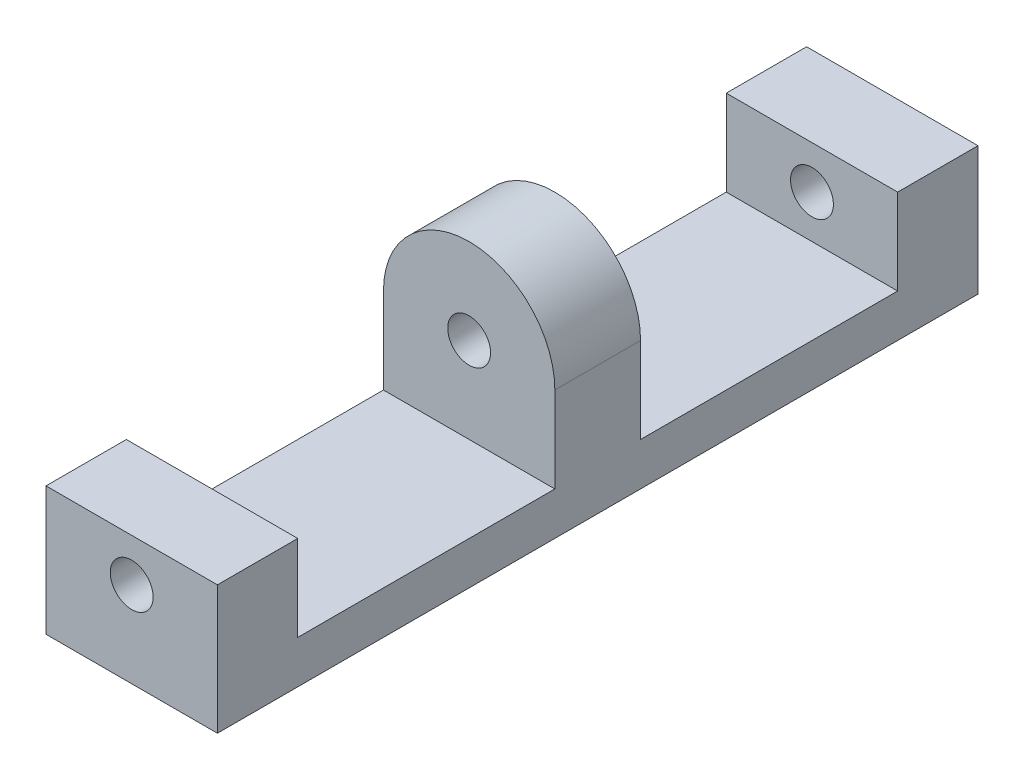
ISO-10303-21;
HEADER;
FILE_DESCRIPTION(('STEP AP214'),'2;1');
FILE_NAME('part.step','',(''),(''),'','','');
FILE_SCHEMA(('AUTOMOTIVE_DESIGN { 1 0 10303 214 1 1 1 1 }'));
ENDSEC;
DATA;
#1=APPLICATION_CONTEXT('core data for automotive mechanical design processes');
#2=APPLICATION_PROTOCOL_DEFINITION('international standard','automotive_design',2000,#1);
#3=PRODUCT_CONTEXT('',#1,'mechanical');
#4=PRODUCT('Part','Part','',(#3));
#5=PRODUCT_RELATED_PRODUCT_CATEGORY('part','',(#4));
#6=PRODUCT_DEFINITION_FORMATION('','',#4);
#7=PRODUCT_DEFINITION_CONTEXT('part definition',#1,'design');
#8=PRODUCT_DEFINITION('design','',#6,#7);
#9=PRODUCT_DEFINITION_SHAPE('','',#8);
#10=(LENGTH_UNIT() NAMED_UNIT(*) SI_UNIT(.MILLI.,.METRE.));
#11=(NAMED_UNIT(*) PLANE_ANGLE_UNIT() SI_UNIT($,.RADIAN.));
#12=(NAMED_UNIT(*) SI_UNIT($,.STERADIAN.) SOLID_ANGLE_UNIT());
#13=UNCERTAINTY_MEASURE_WITH_UNIT(LENGTH_MEASURE(1.E-05),#10,'distance_accuracy_value','');
#14=(GEOMETRIC_REPRESENTATION_CONTEXT(3) GLOBAL_UNCERTAINTY_ASSIGNED_CONTEXT((#13)) GLOBAL_UNIT_ASSIGNED_CONTEXT((#10,
#11,#12)) REPRESENTATION_CONTEXT('',''));
#15=CARTESIAN_POINT('',(0.,0.,0.));
#16=DIRECTION('',(0.,0.,1.));
#17=DIRECTION('',(1.,0.,0.));
#18=AXIS2_PLACEMENT_3D('',#15,#16,#17);
#19=CARTESIAN_POINT('',(50.8,0.,225.425));
#20=DIRECTION('',(-1.,0.,0.));
#21=DIRECTION('',(0.,0.,1.));
#22=AXIS2_PLACEMENT_3D('',#19,#20,#21);
#23=PLANE('',#22);
#24=DIRECTION('',(0.,0.,1.));
#25=VECTOR('',#24,1.);
#26=CARTESIAN_POINT('',(50.8,38.1,-199.542692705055));
#27=LINE('',#26,#25);
#28=CARTESIAN_POINT('',(50.8,38.1,100.0125));
#29=VERTEX_POINT('',#28);
#30=CARTESIAN_POINT('',(50.8,38.1,125.4125));
#31=VERTEX_POINT('',#30);
#32=EDGE_CURVE('E136',#29,#31,#27,.T.);
#33=ORIENTED_EDGE('',*,*,#32,.T.);
#34=DIRECTION('',(0.,-1.,0.));
#35=VECTOR('',#34,1.);
#36=CARTESIAN_POINT('',(50.8,63.5,125.4125));
#37=LINE('',#36,#35);
#38=CARTESIAN_POINT('',(50.8,12.7,125.4125));
#39=VERTEX_POINT('',#38);
#40=EDGE_CURVE('E239',#31,#39,#37,.T.);
#41=ORIENTED_EDGE('',*,*,#40,.T.);
#42=DIRECTION('',(0.,0.,-1.));
#43=VECTOR('',#42,1.);
#44=CARTESIAN_POINT('',(50.8,12.7,201.6125));
#45=LINE('',#44,#43);
#46=CARTESIAN_POINT('',(50.8,12.7,201.6125));
#47=VERTEX_POINT('',#46);
#48=EDGE_CURVE('E173',#47,#39,#45,.T.);
#49=ORIENTED_EDGE('',*,*,#48,.F.);
#50=DIRECTION('',(0.,-1.,0.));
#51=VECTOR('',#50,1.);
#52=CARTESIAN_POINT('',(50.8,38.1,201.6125));
#53=LINE('',#52,#51);
#54=CARTESIAN_POINT('',(50.8,38.1,201.6125));
#55=VERTEX_POINT('',#54);
#56=EDGE_CURVE('E158',#55,#47,#53,.T.);
#57=ORIENTED_EDGE('',*,*,#56,.F.);
#58=DIRECTION('',(0.,0.,-1.));
#59=VECTOR('',#58,1.);
#60=CARTESIAN_POINT('',(50.8,38.1,225.425));
#61=LINE('',#60,#59);
#62=CARTESIAN_POINT('',(50.8,38.1,225.425));
#63=VERTEX_POINT('',#62);
#64=EDGE_CURVE('E211',#63,#55,#61,.T.);
#65=ORIENTED_EDGE('',*,*,#64,.F.);
#66=DIRECTION('',(0.,1.,0.));
#67=VECTOR('',#66,1.);
#68=CARTESIAN_POINT('',(50.8,0.,225.425));
#69=LINE('',#68,#67);
#70=CARTESIAN_POINT('',(50.8,0.,225.425));
#71=VERTEX_POINT('',#70);
#72=EDGE_CURVE('E193',#71,#63,#69,.T.);
#73=ORIENTED_EDGE('',*,*,#72,.F.);
#74=DIRECTION('',(0.,0.,-1.));
#75=VECTOR('',#74,1.);
#76=CARTESIAN_POINT('',(50.8,0.,225.425));
#77=LINE('',#76,#75);
#78=CARTESIAN_POINT('',(50.8,0.,0.));
#79=VERTEX_POINT('',#78);
#80=EDGE_CURVE('E45',#71,#79,#77,.T.);
#81=ORIENTED_EDGE('',*,*,#80,.T.);
#82=DIRECTION('',(0.,1.,0.));
#83=VECTOR('',#82,1.);
#84=CARTESIAN_POINT('',(50.8,0.,0.));
#85=LINE('',#84,#83);
#86=CARTESIAN_POINT('',(50.8,38.1,0.));
#87=VERTEX_POINT('',#86);
#88=EDGE_CURVE('E202',#79,#87,#85,.T.);
#89=ORIENTED_EDGE('',*,*,#88,.T.);
#90=CARTESIAN_POINT('',(50.8,38.1,23.8125));
#91=VERTEX_POINT('',#90);
#92=EDGE_CURVE('E210',#91,#87,#61,.T.);
#93=ORIENTED_EDGE('',*,*,#92,.F.);
#94=DIRECTION('',(0.,1.,0.));
#95=VECTOR('',#94,1.);
#96=CARTESIAN_POINT('',(50.8,38.1,23.8125));
#97=LINE('',#96,#95);
#98=CARTESIAN_POINT('',(50.8,12.7,23.8125));
#99=VERTEX_POINT('',#98);
#100=EDGE_CURVE('E163',#99,#91,#97,.T.);
#101=ORIENTED_EDGE('',*,*,#100,.F.);
#102=CARTESIAN_POINT('',(50.8,12.7,100.0125));
#103=VERTEX_POINT('',#102);
#104=EDGE_CURVE('E143',#103,#99,#45,.T.);
#105=ORIENTED_EDGE('',*,*,#104,.F.);
#106=DIRECTION('',(0.,-1.,0.));
#107=VECTOR('',#106,1.);
#108=CARTESIAN_POINT('',(50.8,63.5,100.0125));
#109=LINE('',#108,#107);
#110=EDGE_CURVE('E130',#29,#103,#109,.T.);
#111=ORIENTED_EDGE('',*,*,#110,.F.);
#112=EDGE_LOOP('',(#33,#41,#49,#57,#65,#73,#81,#89,#93,#101,#105,#111));
#113=FACE_BOUND('',#112,.T.);
#114=ADVANCED_FACE('F36',(#113),#23,.F.);
#115=CARTESIAN_POINT('',(0.,12.7,201.6125));
#116=DIRECTION('',(0.,-1.,0.));
#117=DIRECTION('',(0.,0.,-1.));
#118=AXIS2_PLACEMENT_3D('',#115,#116,#117);
#119=PLANE('',#118);
#120=DIRECTION('',(-1.,0.,0.));
#121=VECTOR('',#120,1.);
#122=CARTESIAN_POINT('',(50.8,12.7,100.0125));
#123=LINE('',#122,#121);
#124=CARTESIAN_POINT('',(0.,12.7,100.0125));
#125=VERTEX_POINT('',#124);
#126=EDGE_CURVE('E234',#103,#125,#123,.T.);
#127=ORIENTED_EDGE('',*,*,#126,.F.);
#128=ORIENTED_EDGE('',*,*,#104,.T.);
#129=DIRECTION('',(1.,0.,0.));
#130=VECTOR('',#129,1.);
#131=CARTESIAN_POINT('',(0.,12.7,23.8125));
#132=LINE('',#131,#130);
#133=CARTESIAN_POINT('',(0.,12.7,23.8125));
#134=VERTEX_POINT('',#133);
#135=EDGE_CURVE('E183',#134,#99,#132,.T.);
#136=ORIENTED_EDGE('',*,*,#135,.F.);
#137=DIRECTION('',(0.,0.,-1.));
#138=VECTOR('',#137,1.);
#139=CARTESIAN_POINT('',(0.,12.7,201.6125));
#140=LINE('',#139,#138);
#141=EDGE_CURVE('E162',#125,#134,#140,.T.);
#142=ORIENTED_EDGE('',*,*,#141,.F.);
#143=EDGE_LOOP('',(#127,#128,#136,#142));
#144=FACE_BOUND('',#143,.T.);
#145=ADVANCED_FACE('F233',(#144),#119,.F.);
#146=DIRECTION('',(1.,0.,0.));
#147=VECTOR('',#146,1.);
#148=CARTESIAN_POINT('',(50.8,12.7,125.4125));
#149=LINE('',#148,#147);
#150=CARTESIAN_POINT('',(0.,12.7,125.4125));
#151=VERTEX_POINT('',#150);
#152=EDGE_CURVE('E235',#151,#39,#149,.T.);
#153=ORIENTED_EDGE('',*,*,#152,.F.);
#154=CARTESIAN_POINT('',(0.,12.7,201.6125));
#155=VERTEX_POINT('',#154);
#156=EDGE_CURVE('E164',#155,#151,#140,.T.);
#157=ORIENTED_EDGE('',*,*,#156,.F.);
#158=DIRECTION('',(1.,0.,0.));
#159=VECTOR('',#158,1.);
#160=CARTESIAN_POINT('',(0.,12.7,201.6125));
#161=LINE('',#160,#159);
#162=EDGE_CURVE('E170',#155,#47,#161,.T.);
#163=ORIENTED_EDGE('',*,*,#162,.T.);
#164=ORIENTED_EDGE('',*,*,#48,.T.);
#165=EDGE_LOOP('',(#153,#157,#163,#164));
#166=FACE_BOUND('',#165,.T.);
#167=ADVANCED_FACE('F250',(#166),#119,.F.);
#168=CARTESIAN_POINT('',(0.,38.1,225.425));
#169=DIRECTION('',(0.,-1.,0.));
#170=DIRECTION('',(0.,0.,-1.));
#171=AXIS2_PLACEMENT_3D('',#168,#169,#170);
#172=PLANE('',#171);
#173=ORIENTED_EDGE('',*,*,#64,.T.);
#174=DIRECTION('',(1.,0.,0.));
#175=VECTOR('',#174,1.);
#176=CARTESIAN_POINT('',(0.,38.1,201.6125));
#177=LINE('',#176,#175);
#178=CARTESIAN_POINT('',(0.,38.1,201.6125));
#179=VERTEX_POINT('',#178);
#180=EDGE_CURVE('E177',#179,#55,#177,.T.);
#181=ORIENTED_EDGE('',*,*,#180,.F.);
#182=DIRECTION('',(0.,0.,-1.));
#183=VECTOR('',#182,1.);
#184=CARTESIAN_POINT('',(0.,38.1,225.425));
#185=LINE('',#184,#183);
#186=CARTESIAN_POINT('',(0.,38.1,225.425));
#187=VERTEX_POINT('',#186);
#188=EDGE_CURVE('E207',#187,#179,#185,.T.);
#189=ORIENTED_EDGE('',*,*,#188,.F.);
#190=DIRECTION('',(-1.,0.,0.));
#191=VECTOR('',#190,1.);
#192=CARTESIAN_POINT('',(0.,38.1,225.425));
#193=LINE('',#192,#191);
#194=EDGE_CURVE('E195',#63,#187,#193,.T.);
#195=ORIENTED_EDGE('',*,*,#194,.F.);
#196=EDGE_LOOP('',(#173,#181,#189,#195));
#197=FACE_BOUND('',#196,.T.);
#198=ADVANCED_FACE('F259',(#197),#172,.F.);
#199=CARTESIAN_POINT('',(0.,0.,225.425));
#200=DIRECTION('',(1.,0.,0.));
#201=DIRECTION('',(0.,0.,-1.));
#202=AXIS2_PLACEMENT_3D('',#199,#200,#201);
#203=PLANE('',#202);
#204=DIRECTION('',(0.,-1.,0.));
#205=VECTOR('',#204,1.);
#206=CARTESIAN_POINT('',(0.,63.5,125.4125));
#207=LINE('',#206,#205);
#208=CARTESIAN_POINT('',(0.,38.1,125.4125));
#209=VERTEX_POINT('',#208);
#210=EDGE_CURVE('E149',#209,#151,#207,.T.);
#211=ORIENTED_EDGE('',*,*,#210,.F.);
#212=DIRECTION('',(0.,0.,1.));
#213=VECTOR('',#212,1.);
#214=CARTESIAN_POINT('',(0.,38.1,-199.542692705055));
#215=LINE('',#214,#213);
#216=CARTESIAN_POINT('',(0.,38.1,100.0125));
#217=VERTEX_POINT('',#216);
#218=EDGE_CURVE('E139',#217,#209,#215,.T.);
#219=ORIENTED_EDGE('',*,*,#218,.F.);
#220=DIRECTION('',(0.,-1.,0.));
#221=VECTOR('',#220,1.);
#222=CARTESIAN_POINT('',(0.,63.5,100.0125));
#223=LINE('',#222,#221);
#224=EDGE_CURVE('E60',#217,#125,#223,.T.);
#225=ORIENTED_EDGE('',*,*,#224,.T.);
#226=ORIENTED_EDGE('',*,*,#141,.T.);
#227=DIRECTION('',(0.,1.,0.));
#228=VECTOR('',#227,1.);
#229=CARTESIAN_POINT('',(0.,38.1,23.8125));
#230=LINE('',#229,#228);
#231=CARTESIAN_POINT('',(0.,38.1,23.8125));
#232=VERTEX_POINT('',#231);
#233=EDGE_CURVE('E167',#134,#232,#230,.T.);
#234=ORIENTED_EDGE('',*,*,#233,.T.);
#235=CARTESIAN_POINT('',(0.,38.1,0.));
#236=VERTEX_POINT('',#235);
#237=EDGE_CURVE('E197',#232,#236,#185,.T.);
#238=ORIENTED_EDGE('',*,*,#237,.T.);
#239=DIRECTION('',(0.,-1.,0.));
#240=VECTOR('',#239,1.);
#241=CARTESIAN_POINT('',(0.,0.,0.));
#242=LINE('',#241,#240);
#243=CARTESIAN_POINT('',(0.,0.,0.));
#244=VERTEX_POINT('',#243);
#245=EDGE_CURVE('E179',#236,#244,#242,.T.);
#246=ORIENTED_EDGE('',*,*,#245,.T.);
#247=DIRECTION('',(0.,0.,-1.));
#248=VECTOR('',#247,1.);
#249=CARTESIAN_POINT('',(0.,0.,225.425));
#250=LINE('',#249,#248);
#251=CARTESIAN_POINT('',(0.,0.,225.425));
#252=VERTEX_POINT('',#251);
#253=EDGE_CURVE('E11',#252,#244,#250,.T.);
#254=ORIENTED_EDGE('',*,*,#253,.F.);
#255=DIRECTION('',(0.,-1.,0.));
#256=VECTOR('',#255,1.);
#257=CARTESIAN_POINT('',(0.,0.,225.425));
#258=LINE('',#257,#256);
#259=EDGE_CURVE('E187',#187,#252,#258,.T.);
#260=ORIENTED_EDGE('',*,*,#259,.F.);
#261=ORIENTED_EDGE('',*,*,#188,.T.);
#262=DIRECTION('',(0.,-1.,0.));
#263=VECTOR('',#262,1.);
#264=CARTESIAN_POINT('',(0.,38.1,201.6125));
#265=LINE('',#264,#263);
#266=EDGE_CURVE('E159',#179,#155,#265,.T.);
#267=ORIENTED_EDGE('',*,*,#266,.T.);
#268=ORIENTED_EDGE('',*,*,#156,.T.);
#269=EDGE_LOOP('',(#211,#219,#225,#226,#234,#238,#246,#254,#260,#261,#267,#268));
#270=FACE_BOUND('',#269,.T.);
#271=ADVANCED_FACE('F38',(#270),#203,.F.);
#272=CARTESIAN_POINT('',(0.,0.,225.425));
#273=DIRECTION('',(0.,1.,0.));
#274=DIRECTION('',(0.,0.,1.));
#275=AXIS2_PLACEMENT_3D('',#272,#273,#274);
#276=PLANE('',#275);
#277=DIRECTION('',(1.,0.,0.));
#278=VECTOR('',#277,1.);
#279=CARTESIAN_POINT('',(0.,0.,0.));
#280=LINE('',#279,#278);
#281=EDGE_CURVE('E200',#244,#79,#280,.T.);
#282=ORIENTED_EDGE('',*,*,#281,.T.);
#283=ORIENTED_EDGE('',*,*,#80,.F.);
#284=DIRECTION('',(1.,0.,0.));
#285=VECTOR('',#284,1.);
#286=CARTESIAN_POINT('',(0.,0.,225.425));
#287=LINE('',#286,#285);
#288=EDGE_CURVE('E190',#252,#71,#287,.T.);
#289=ORIENTED_EDGE('',*,*,#288,.F.);
#290=ORIENTED_EDGE('',*,*,#253,.T.);
#291=EDGE_LOOP('',(#282,#283,#289,#290));
#292=FACE_BOUND('',#291,.T.);
#293=ADVANCED_FACE('F264',(#292),#276,.F.);
#294=ORIENTED_EDGE('',*,*,#237,.F.);
#295=DIRECTION('',(1.,0.,0.));
#296=VECTOR('',#295,1.);
#297=CARTESIAN_POINT('',(0.,38.1,23.8125));
#298=LINE('',#297,#296);
#299=EDGE_CURVE('E180',#232,#91,#298,.T.);
#300=ORIENTED_EDGE('',*,*,#299,.T.);
#301=ORIENTED_EDGE('',*,*,#92,.T.);
#302=DIRECTION('',(-1.,0.,0.));
#303=VECTOR('',#302,1.);
#304=CARTESIAN_POINT('',(0.,38.1,0.));
#305=LINE('',#304,#303);
#306=EDGE_CURVE('E191',#87,#236,#305,.T.);
#307=ORIENTED_EDGE('',*,*,#306,.T.);
#308=EDGE_LOOP('',(#294,#300,#301,#307));
#309=FACE_BOUND('',#308,.T.);
#310=ADVANCED_FACE('F227',(#309),#172,.F.);
#311=CARTESIAN_POINT('',(0.,38.1,225.425));
#312=DIRECTION('',(0.,0.,-1.));
#313=DIRECTION('',(-1.,0.,0.));
#314=AXIS2_PLACEMENT_3D('',#311,#312,#313);
#315=PLANE('',#314);
#316=CARTESIAN_POINT('',(25.4,25.4,225.425));
#317=DIRECTION('',(0.,0.,1.));
#318=DIRECTION('',(1.,0.,0.));
#319=AXIS2_PLACEMENT_3D('',#316,#317,#318);
#320=CIRCLE('',#319,6.35);
#321=CARTESIAN_POINT('',(31.75,25.4,225.425));
#322=VERTEX_POINT('',#321);
#323=EDGE_CURVE('E144',#322,#322,#320,.T.);
#324=ORIENTED_EDGE('',*,*,#323,.F.);
#325=EDGE_LOOP('',(#324));
#326=FACE_BOUND('',#325,.T.);
#327=ORIENTED_EDGE('',*,*,#259,.T.);
#328=ORIENTED_EDGE('',*,*,#288,.T.);
#329=ORIENTED_EDGE('',*,*,#72,.T.);
#330=ORIENTED_EDGE('',*,*,#194,.T.);
#331=EDGE_LOOP('',(#327,#328,#329,#330));
#332=FACE_BOUND('',#331,.T.);
#333=ADVANCED_FACE('F262',(#326,#332),#315,.F.);
#334=CARTESIAN_POINT('',(0.,38.1,0.));
#335=DIRECTION('',(0.,0.,-1.));
#336=DIRECTION('',(-1.,0.,0.));
#337=AXIS2_PLACEMENT_3D('',#334,#335,#336);
#338=PLANE('',#337);
#339=CARTESIAN_POINT('',(25.4,25.4,0.));
#340=DIRECTION('',(0.,0.,1.));
#341=DIRECTION('',(1.,0.,0.));
#342=AXIS2_PLACEMENT_3D('',#339,#340,#341);
#343=CIRCLE('',#342,6.35);
#344=CARTESIAN_POINT('',(31.75,25.4,0.));
#345=VERTEX_POINT('',#344);
#346=EDGE_CURVE('E147',#345,#345,#343,.T.);
#347=ORIENTED_EDGE('',*,*,#346,.T.);
#348=EDGE_LOOP('',(#347));
#349=FACE_BOUND('',#348,.T.);
#350=ORIENTED_EDGE('',*,*,#245,.F.);
#351=ORIENTED_EDGE('',*,*,#306,.F.);
#352=ORIENTED_EDGE('',*,*,#88,.F.);
#353=ORIENTED_EDGE('',*,*,#281,.F.);
#354=EDGE_LOOP('',(#350,#351,#352,#353));
#355=FACE_BOUND('',#354,.T.);
#356=ADVANCED_FACE('F224',(#349,#355),#338,.T.);
#357=CARTESIAN_POINT('',(0.,38.1,201.6125));
#358=DIRECTION('',(0.,0.,1.));
#359=DIRECTION('',(1.,0.,0.));
#360=AXIS2_PLACEMENT_3D('',#357,#358,#359);
#361=PLANE('',#360);
#362=CARTESIAN_POINT('',(25.4,25.4,201.6125));
#363=DIRECTION('',(0.,0.,1.));
#364=DIRECTION('',(1.,0.,0.));
#365=AXIS2_PLACEMENT_3D('',#362,#363,#364);
#366=CIRCLE('',#365,6.35);
#367=CARTESIAN_POINT('',(31.75,25.4,201.6125));
#368=VERTEX_POINT('',#367);
#369=EDGE_CURVE('E155',#368,#368,#366,.T.);
#370=ORIENTED_EDGE('',*,*,#369,.T.);
#371=EDGE_LOOP('',(#370));
#372=FACE_BOUND('',#371,.T.);
#373=ORIENTED_EDGE('',*,*,#56,.T.);
#374=ORIENTED_EDGE('',*,*,#162,.F.);
#375=ORIENTED_EDGE('',*,*,#266,.F.);
#376=ORIENTED_EDGE('',*,*,#180,.T.);
#377=EDGE_LOOP('',(#373,#374,#375,#376));
#378=FACE_BOUND('',#377,.T.);
#379=ADVANCED_FACE('F256',(#372,#378),#361,.F.);
#380=CARTESIAN_POINT('',(0.,38.1,23.8125));
#381=DIRECTION('',(0.,0.,-1.));
#382=DIRECTION('',(-1.,0.,0.));
#383=AXIS2_PLACEMENT_3D('',#380,#381,#382);
#384=PLANE('',#383);
#385=CARTESIAN_POINT('',(25.4,25.4,23.8125));
#386=DIRECTION('',(0.,0.,-1.));
#387=DIRECTION('',(-1.,0.,0.));
#388=AXIS2_PLACEMENT_3D('',#385,#386,#387);
#389=CIRCLE('',#388,6.35);
#390=CARTESIAN_POINT('',(31.75,25.4,23.8125));
#391=VERTEX_POINT('',#390);
#392=EDGE_CURVE('E40',#391,#391,#389,.T.);
#393=ORIENTED_EDGE('',*,*,#392,.T.);
#394=EDGE_LOOP('',(#393));
#395=FACE_BOUND('',#394,.T.);
#396=ORIENTED_EDGE('',*,*,#100,.T.);
#397=ORIENTED_EDGE('',*,*,#299,.F.);
#398=ORIENTED_EDGE('',*,*,#233,.F.);
#399=ORIENTED_EDGE('',*,*,#135,.T.);
#400=EDGE_LOOP('',(#396,#397,#398,#399));
#401=FACE_BOUND('',#400,.T.);
#402=ADVANCED_FACE('F229',(#395,#401),#384,.F.);
#403=CARTESIAN_POINT('',(25.4,25.4,0.));
#404=DIRECTION('',(0.,0.,1.));
#405=DIRECTION('',(1.,0.,0.));
#406=AXIS2_PLACEMENT_3D('',#403,#404,#405);
#407=CYLINDRICAL_SURFACE('',#406,6.35);
#408=CARTESIAN_POINT('',(31.75,25.4,0.));
#409=CARTESIAN_POINT('',(31.75,25.4,0.248046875));
#410=CARTESIAN_POINT('',(31.75,25.4,0.49609375));
#411=CARTESIAN_POINT('',(31.75,25.4,0.9921875));
#412=CARTESIAN_POINT('',(31.75,25.4,1.240234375));
#413=CARTESIAN_POINT('',(31.75,25.4,1.736328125));
#414=CARTESIAN_POINT('',(31.75,25.4,1.984375));
#415=CARTESIAN_POINT('',(31.75,25.4,2.48046875));
#416=CARTESIAN_POINT('',(31.75,25.4,2.728515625));
#417=CARTESIAN_POINT('',(31.75,25.4,3.224609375));
#418=CARTESIAN_POINT('',(31.75,25.4,3.47265625));
#419=CARTESIAN_POINT('',(31.75,25.4,3.96875));
#420=CARTESIAN_POINT('',(31.75,25.4,4.216796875));
#421=CARTESIAN_POINT('',(31.75,25.4,4.712890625));
#422=CARTESIAN_POINT('',(31.75,25.4,4.9609375));
#423=CARTESIAN_POINT('',(31.75,25.4,5.45703125));
#424=CARTESIAN_POINT('',(31.75,25.4,5.705078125));
#425=CARTESIAN_POINT('',(31.75,25.4,6.201171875));
#426=CARTESIAN_POINT('',(31.75,25.4,6.44921875));
#427=CARTESIAN_POINT('',(31.75,25.4,6.9453125));
#428=CARTESIAN_POINT('',(31.75,25.4,7.193359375));
#429=CARTESIAN_POINT('',(31.75,25.4,7.689453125));
#430=CARTESIAN_POINT('',(31.75,25.4,7.9375));
#431=CARTESIAN_POINT('',(31.75,25.4,8.43359375));
#432=CARTESIAN_POINT('',(31.75,25.4,8.681640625));
#433=CARTESIAN_POINT('',(31.75,25.4,9.177734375));
#434=CARTESIAN_POINT('',(31.75,25.4,9.42578125));
#435=CARTESIAN_POINT('',(31.75,25.4,9.92187499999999));
#436=CARTESIAN_POINT('',(31.75,25.4,10.169921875));
#437=CARTESIAN_POINT('',(31.75,25.4,10.666015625));
#438=CARTESIAN_POINT('',(31.75,25.4,10.9140625));
#439=CARTESIAN_POINT('',(31.75,25.4,11.41015625));
#440=CARTESIAN_POINT('',(31.75,25.4,11.658203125));
#441=CARTESIAN_POINT('',(31.75,25.4,12.154296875));
#442=CARTESIAN_POINT('',(31.75,25.4,12.40234375));
#443=CARTESIAN_POINT('',(31.75,25.4,12.8984375));
#444=CARTESIAN_POINT('',(31.75,25.4,13.146484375));
#445=CARTESIAN_POINT('',(31.75,25.4,13.642578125));
#446=CARTESIAN_POINT('',(31.75,25.4,13.890625));
#447=CARTESIAN_POINT('',(31.75,25.4,14.38671875));
#448=CARTESIAN_POINT('',(31.75,25.4,14.634765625));
#449=CARTESIAN_POINT('',(31.75,25.4,15.130859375));
#450=CARTESIAN_POINT('',(31.75,25.4,15.37890625));
#451=CARTESIAN_POINT('',(31.75,25.4,15.875));
#452=CARTESIAN_POINT('',(31.75,25.4,16.123046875));
#453=CARTESIAN_POINT('',(31.75,25.4,16.619140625));
#454=CARTESIAN_POINT('',(31.75,25.4,16.8671875));
#455=CARTESIAN_POINT('',(31.75,25.4,17.36328125));
#456=CARTESIAN_POINT('',(31.75,25.4,17.611328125));
#457=CARTESIAN_POINT('',(31.75,25.4,18.107421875));
#458=CARTESIAN_POINT('',(31.75,25.4,18.35546875));
#459=CARTESIAN_POINT('',(31.75,25.4,18.8515625));
#460=CARTESIAN_POINT('',(31.75,25.4,19.099609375));
#461=CARTESIAN_POINT('',(31.75,25.4,19.595703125));
#462=CARTESIAN_POINT('',(31.75,25.4,19.84375));
#463=CARTESIAN_POINT('',(31.75,25.4,20.33984375));
#464=CARTESIAN_POINT('',(31.75,25.4,20.587890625));
#465=CARTESIAN_POINT('',(31.75,25.4,21.083984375));
#466=CARTESIAN_POINT('',(31.75,25.4,21.33203125));
#467=CARTESIAN_POINT('',(31.75,25.4,21.828125));
#468=CARTESIAN_POINT('',(31.75,25.4,22.076171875));
#469=CARTESIAN_POINT('',(31.75,25.4,22.572265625));
#470=CARTESIAN_POINT('',(31.75,25.4,22.8203125));
#471=CARTESIAN_POINT('',(31.75,25.4,23.31640625));
#472=CARTESIAN_POINT('',(31.75,25.4,23.564453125));
#473=CARTESIAN_POINT('',(31.75,25.4,23.8125));
#474=B_SPLINE_CURVE_WITH_KNOTS('',3,(#408,#409,#410,#411,#412,#413,#414,#415,#416,#417,#418,
#419,#420,#421,#422,#423,#424,#425,#426,#427,#428,#429,#430,#431,#432,#433,#434,#435,#436,#437,
#438,#439,#440,#441,#442,#443,#444,#445,#446,#447,#448,#449,#450,#451,#452,#453,#454,#455,#456,
#457,#458,#459,#460,#461,#462,#463,#464,#465,#466,#467,#468,#469,#470,#471,#472,#473),
.UNSPECIFIED.,.F.,.F.,(4,2,2,2,2,2,2,2,2,2,2,2,2,2,2,2,2,2,2,2,2,2,2,2,2,2,2,2,2,2,2,2,4),(0.,
0.744140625,1.48828125,2.232421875,2.9765625,3.720703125,4.46484375,5.208984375,5.953125,
6.697265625,7.44140625,8.185546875,8.9296875,9.67382812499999,10.41796875,11.162109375,11.90625,
12.650390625,13.39453125,14.138671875,14.8828125,15.626953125,16.37109375,17.115234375,
17.859375,18.603515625,19.34765625,20.091796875,20.8359375,21.580078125,22.32421875,
23.068359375,23.8125),.UNSPECIFIED.);
#475=EDGE_CURVE('BSEAM289',#345,#391,#474,.T.);
#476=ORIENTED_EDGE('',*,*,#346,.F.);
#477=ORIENTED_EDGE('',*,*,#392,.F.);
#478=ORIENTED_EDGE('',*,*,#475,.T.);
#479=ORIENTED_EDGE('',*,*,#475,.F.);
#480=EDGE_LOOP('',(#476,#478,#477,#479));
#481=FACE_BOUND('',#480,.T.);
#482=ADVANCED_FACE('F289',(#481),#407,.F.);
#483=CARTESIAN_POINT('',(31.75,25.4,225.425));
#484=CARTESIAN_POINT('',(31.75,25.4,225.176953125));
#485=CARTESIAN_POINT('',(31.75,25.4,224.92890625));
#486=CARTESIAN_POINT('',(31.75,25.4,224.4328125));
#487=CARTESIAN_POINT('',(31.75,25.4,224.184765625));
#488=CARTESIAN_POINT('',(31.75,25.4,223.688671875));
#489=CARTESIAN_POINT('',(31.75,25.4,223.440625));
#490=CARTESIAN_POINT('',(31.75,25.4,222.94453125));
#491=CARTESIAN_POINT('',(31.75,25.4,222.696484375));
#492=CARTESIAN_POINT('',(31.75,25.4,222.200390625));
#493=CARTESIAN_POINT('',(31.75,25.4,221.95234375));
#494=CARTESIAN_POINT('',(31.75,25.4,221.45625));
#495=CARTESIAN_POINT('',(31.75,25.4,221.208203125));
#496=CARTESIAN_POINT('',(31.75,25.4,220.712109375));
#497=CARTESIAN_POINT('',(31.75,25.4,220.4640625));
#498=CARTESIAN_POINT('',(31.75,25.4,219.96796875));
#499=CARTESIAN_POINT('',(31.75,25.4,219.719921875));
#500=CARTESIAN_POINT('',(31.75,25.4,219.223828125));
#501=CARTESIAN_POINT('',(31.75,25.4,218.97578125));
#502=CARTESIAN_POINT('',(31.75,25.4,218.4796875));
#503=CARTESIAN_POINT('',(31.75,25.4,218.231640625));
#504=CARTESIAN_POINT('',(31.75,25.4,217.735546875));
#505=CARTESIAN_POINT('',(31.75,25.4,217.4875));
#506=CARTESIAN_POINT('',(31.75,25.4,216.99140625));
#507=CARTESIAN_POINT('',(31.75,25.4,216.743359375));
#508=CARTESIAN_POINT('',(31.75,25.4,216.247265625));
#509=CARTESIAN_POINT('',(31.75,25.4,215.99921875));
#510=CARTESIAN_POINT('',(31.75,25.4,215.503125));
#511=CARTESIAN_POINT('',(31.75,25.4,215.255078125));
#512=CARTESIAN_POINT('',(31.75,25.4,214.758984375));
#513=CARTESIAN_POINT('',(31.75,25.4,214.5109375));
#514=CARTESIAN_POINT('',(31.75,25.4,214.01484375));
#515=CARTESIAN_POINT('',(31.75,25.4,213.766796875));
#516=CARTESIAN_POINT('',(31.75,25.4,213.270703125));
#517=CARTESIAN_POINT('',(31.75,25.4,213.02265625));
#518=CARTESIAN_POINT('',(31.75,25.4,212.5265625));
#519=CARTESIAN_POINT('',(31.75,25.4,212.278515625));
#520=CARTESIAN_POINT('',(31.75,25.4,211.782421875));
#521=CARTESIAN_POINT('',(31.75,25.4,211.534375));
#522=CARTESIAN_POINT('',(31.75,25.4,211.03828125));
#523=CARTESIAN_POINT('',(31.75,25.4,210.790234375));
#524=CARTESIAN_POINT('',(31.75,25.4,210.294140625));
#525=CARTESIAN_POINT('',(31.75,25.4,210.04609375));
#526=CARTESIAN_POINT('',(31.75,25.4,209.55));
#527=CARTESIAN_POINT('',(31.75,25.4,209.301953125));
#528=CARTESIAN_POINT('',(31.75,25.4,208.805859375));
#529=CARTESIAN_POINT('',(31.75,25.4,208.5578125));
#530=CARTESIAN_POINT('',(31.75,25.4,208.06171875));
#531=CARTESIAN_POINT('',(31.75,25.4,207.813671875));
#532=CARTESIAN_POINT('',(31.75,25.4,207.317578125));
#533=CARTESIAN_POINT('',(31.75,25.4,207.06953125));
#534=CARTESIAN_POINT('',(31.75,25.4,206.5734375));
#535=CARTESIAN_POINT('',(31.75,25.4,206.325390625));
#536=CARTESIAN_POINT('',(31.75,25.4,205.829296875));
#537=CARTESIAN_POINT('',(31.75,25.4,205.58125));
#538=CARTESIAN_POINT('',(31.75,25.4,205.08515625));
#539=CARTESIAN_POINT('',(31.75,25.4,204.837109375));
#540=CARTESIAN_POINT('',(31.75,25.4,204.341015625));
#541=CARTESIAN_POINT('',(31.75,25.4,204.09296875));
#542=CARTESIAN_POINT('',(31.75,25.4,203.596875));
#543=CARTESIAN_POINT('',(31.75,25.4,203.348828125));
#544=CARTESIAN_POINT('',(31.75,25.4,202.852734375));
#545=CARTESIAN_POINT('',(31.75,25.4,202.6046875));
#546=CARTESIAN_POINT('',(31.75,25.4,202.10859375));
#547=CARTESIAN_POINT('',(31.75,25.4,201.860546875));
#548=CARTESIAN_POINT('',(31.75,25.4,201.6125));
#549=B_SPLINE_CURVE_WITH_KNOTS('',3,(#483,#484,#485,#486,#487,#488,#489,#490,#491,#492,#493,
#494,#495,#496,#497,#498,#499,#500,#501,#502,#503,#504,#505,#506,#507,#508,#509,#510,#511,#512,
#513,#514,#515,#516,#517,#518,#519,#520,#521,#522,#523,#524,#525,#526,#527,#528,#529,#530,#531,
#532,#533,#534,#535,#536,#537,#538,#539,#540,#541,#542,#543,#544,#545,#546,#547,#548),
.UNSPECIFIED.,.F.,.F.,(4,2,2,2,2,2,2,2,2,2,2,2,2,2,2,2,2,2,2,2,2,2,2,2,2,2,2,2,2,2,2,2,4),(0.,
0.744140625,1.48828125,2.232421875,2.9765625,3.720703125,4.46484375,5.208984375,5.953125,
6.697265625,7.44140625,8.18554687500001,8.92968750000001,9.67382812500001,10.41796875,
11.162109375,11.90625,12.650390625,13.39453125,14.138671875,14.8828125,15.626953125,16.37109375,
17.115234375,17.859375,18.603515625,19.34765625,20.091796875,20.8359375,21.580078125,
22.32421875,23.068359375,23.8125),.UNSPECIFIED.);
#550=EDGE_CURVE('BSEAM291',#322,#368,#549,.T.);
#551=ORIENTED_EDGE('',*,*,#323,.T.);
#552=ORIENTED_EDGE('',*,*,#369,.F.);
#553=ORIENTED_EDGE('',*,*,#550,.T.);
#554=ORIENTED_EDGE('',*,*,#550,.F.);
#555=EDGE_LOOP('',(#551,#553,#552,#554));
#556=FACE_BOUND('',#555,.T.);
#557=ADVANCED_FACE('F291',(#556),#407,.F.);
#558=CARTESIAN_POINT('',(50.8,63.5,100.0125));
#559=DIRECTION('',(0.,0.,1.));
#560=DIRECTION('',(1.,0.,0.));
#561=AXIS2_PLACEMENT_3D('',#558,#559,#560);
#562=PLANE('',#561);
#563=CARTESIAN_POINT('',(25.4,38.1,100.0125));
#564=DIRECTION('',(0.,0.,1.));
#565=DIRECTION('',(1.,0.,0.));
#566=AXIS2_PLACEMENT_3D('',#563,#564,#565);
#567=CIRCLE('',#566,6.35000000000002);
#568=CARTESIAN_POINT('',(31.75,38.1,100.0125));
#569=VERTEX_POINT('',#568);
#570=EDGE_CURVE('E236',#569,#569,#567,.F.);
#571=ORIENTED_EDGE('',*,*,#570,.F.);
#572=EDGE_LOOP('',(#571));
#573=FACE_BOUND('',#572,.T.);
#574=ORIENTED_EDGE('',*,*,#224,.F.);
#575=CARTESIAN_POINT('',(25.4,38.1,100.0125));
#576=DIRECTION('',(0.,0.,1.));
#577=DIRECTION('',(1.,0.,0.));
#578=AXIS2_PLACEMENT_3D('',#575,#576,#577);
#579=CIRCLE('',#578,25.4);
#580=EDGE_CURVE('E125',#217,#29,#579,.F.);
#581=ORIENTED_EDGE('',*,*,#580,.T.);
#582=ORIENTED_EDGE('',*,*,#110,.T.);
#583=ORIENTED_EDGE('',*,*,#126,.T.);
#584=EDGE_LOOP('',(#574,#581,#582,#583));
#585=FACE_BOUND('',#584,.T.);
#586=ADVANCED_FACE('F127',(#573,#585),#562,.F.);
#587=CARTESIAN_POINT('',(50.8,63.5,125.4125));
#588=DIRECTION('',(0.,0.,-1.));
#589=DIRECTION('',(-1.,0.,0.));
#590=AXIS2_PLACEMENT_3D('',#587,#588,#589);
#591=PLANE('',#590);
#592=CARTESIAN_POINT('',(25.4,38.1,125.4125));
#593=DIRECTION('',(0.,0.,1.));
#594=DIRECTION('',(1.,0.,0.));
#595=AXIS2_PLACEMENT_3D('',#592,#593,#594);
#596=CIRCLE('',#595,6.35000000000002);
#597=CARTESIAN_POINT('',(31.75,38.1,125.4125));
#598=VERTEX_POINT('',#597);
#599=EDGE_CURVE('E133',#598,#598,#596,.T.);
#600=ORIENTED_EDGE('',*,*,#599,.F.);
#601=EDGE_LOOP('',(#600));
#602=FACE_BOUND('',#601,.T.);
#603=ORIENTED_EDGE('',*,*,#40,.F.);
#604=CARTESIAN_POINT('',(25.4,38.1,125.4125));
#605=DIRECTION('',(0.,0.,-1.));
#606=DIRECTION('',(-1.,0.,0.));
#607=AXIS2_PLACEMENT_3D('',#604,#605,#606);
#608=CIRCLE('',#607,25.4);
#609=EDGE_CURVE('E52',#31,#209,#608,.F.);
#610=ORIENTED_EDGE('',*,*,#609,.T.);
#611=ORIENTED_EDGE('',*,*,#210,.T.);
#612=ORIENTED_EDGE('',*,*,#152,.T.);
#613=EDGE_LOOP('',(#603,#610,#611,#612));
#614=FACE_BOUND('',#613,.T.);
#615=ADVANCED_FACE('F247',(#602,#614),#591,.F.);
#616=CARTESIAN_POINT('',(25.4,38.1,-0.001000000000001));
#617=DIRECTION('',(0.,0.,1.));
#618=DIRECTION('',(1.,0.,0.));
#619=AXIS2_PLACEMENT_3D('',#616,#617,#618);
#620=CYLINDRICAL_SURFACE('',#619,6.35000000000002);
#621=ORIENTED_EDGE('',*,*,#599,.T.);
#622=EDGE_LOOP('',(#621));
#623=FACE_BOUND('',#622,.T.);
#624=ORIENTED_EDGE('',*,*,#570,.T.);
#625=EDGE_LOOP('',(#624));
#626=FACE_BOUND('',#625,.T.);
#627=ADVANCED_FACE('F300',(#623,#626),#620,.F.);
#628=CARTESIAN_POINT('',(25.4,38.1,-199.542692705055));
#629=DIRECTION('',(0.,0.,1.));
#630=DIRECTION('',(1.,0.,0.));
#631=AXIS2_PLACEMENT_3D('',#628,#629,#630);
#632=CYLINDRICAL_SURFACE('',#631,25.4);
#633=ORIENTED_EDGE('',*,*,#580,.F.);
#634=ORIENTED_EDGE('',*,*,#218,.T.);
#635=ORIENTED_EDGE('',*,*,#609,.F.);
#636=ORIENTED_EDGE('',*,*,#32,.F.);
#637=EDGE_LOOP('',(#633,#634,#635,#636));
#638=FACE_BOUND('',#637,.T.);
#639=ADVANCED_FACE('F137',(#638),#632,.T.);
#640=CLOSED_SHELL('',(#114,#145,#167,#198,#271,#293,#310,#333,#356,#379,#402,#482,#557,#586,
#615,#627,#639));
#641=MANIFOLD_SOLID_BREP('B2',#640);
#642=ADVANCED_BREP_SHAPE_REPRESENTATION('',(#18,#641),#14);
#643=SHAPE_DEFINITION_REPRESENTATION(#9,#642);
ENDSEC;
END-ISO-10303-21;
